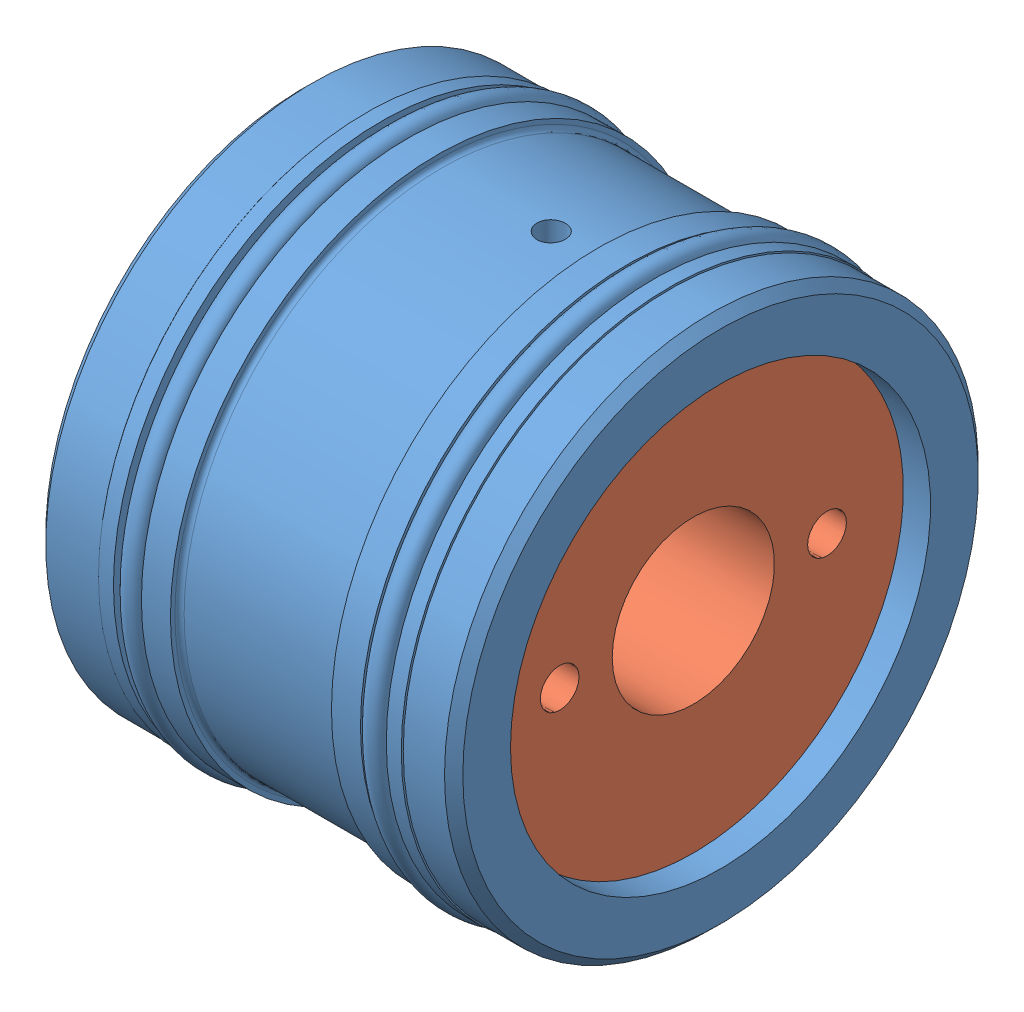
SolidWorks assembly ILC21411300.sldasm, configuration Default (file format 3400). Lengths in mm.
Overall size (39.6 45.26 45.26).
2 component instances, 2 part files, 3 mates.
Components (placement in the parent):
- ILC21411300_BODY-1: ILC21411300_BODY.sldprt [Default] at origin size (34.67 45.26 45.26)
- ILC21411300_PLUNGER-1: ILC21411300_PLUNGER.sldprt [Default] at (15.0749 0 0) x (-1 0 0) z (0 0 1) size (37.34 34.92 34.92)
Mates (geometry in assembly coordinates):
- MID STROKE: distance = 2.2606 mm aligned: plane of ILC21411300_PLUNGER-1 through (15.0749 -6.7437 0) normal (1 0 0); plane of ILC21411300_BODY-1 through (17.3355 22.1869 0) normal (1 0 0)
- Coincident2: coincident aligned: unknown of ILC21411300_PLUNGER-1
- Concentric2: concentric anti-aligned: cylinder of ILC21411300_BODY-1; cylinder of ILC21411300_PLUNGER-1
